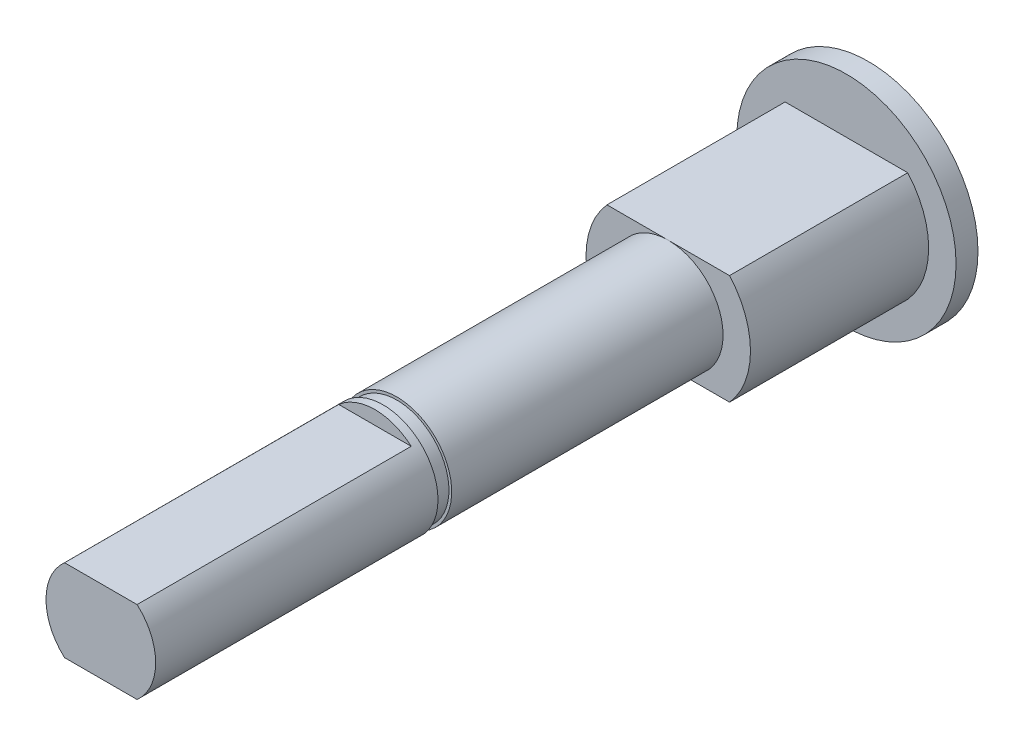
ISO-10303-21;
HEADER;
FILE_DESCRIPTION(('STEP AP214'),'2;1');
FILE_NAME('part.step','',(''),(''),'','','');
FILE_SCHEMA(('AUTOMOTIVE_DESIGN { 1 0 10303 214 1 1 1 1 }'));
ENDSEC;
DATA;
#1=APPLICATION_CONTEXT('core data for automotive mechanical design processes');
#2=APPLICATION_PROTOCOL_DEFINITION('international standard','automotive_design',2000,#1);
#3=PRODUCT_CONTEXT('',#1,'mechanical');
#4=PRODUCT('Part','Part','',(#3));
#5=PRODUCT_RELATED_PRODUCT_CATEGORY('part','',(#4));
#6=PRODUCT_DEFINITION_FORMATION('','',#4);
#7=PRODUCT_DEFINITION_CONTEXT('part definition',#1,'design');
#8=PRODUCT_DEFINITION('design','',#6,#7);
#9=PRODUCT_DEFINITION_SHAPE('','',#8);
#10=(LENGTH_UNIT() NAMED_UNIT(*) SI_UNIT(.MILLI.,.METRE.));
#11=(NAMED_UNIT(*) PLANE_ANGLE_UNIT() SI_UNIT($,.RADIAN.));
#12=(NAMED_UNIT(*) SI_UNIT($,.STERADIAN.) SOLID_ANGLE_UNIT());
#13=UNCERTAINTY_MEASURE_WITH_UNIT(LENGTH_MEASURE(1.E-05),#10,'distance_accuracy_value','');
#14=(GEOMETRIC_REPRESENTATION_CONTEXT(3) GLOBAL_UNCERTAINTY_ASSIGNED_CONTEXT((#13)) GLOBAL_UNIT_ASSIGNED_CONTEXT((#10,
#11,#12)) REPRESENTATION_CONTEXT('',''));
#15=CARTESIAN_POINT('',(0.,0.,0.));
#16=DIRECTION('',(0.,0.,1.));
#17=DIRECTION('',(1.,0.,0.));
#18=AXIS2_PLACEMENT_3D('',#15,#16,#17);
#19=CARTESIAN_POINT('',(0.,0.,17.2));
#20=DIRECTION('',(0.,0.,1.));
#21=DIRECTION('',(1.,0.,0.));
#22=AXIS2_PLACEMENT_3D('',#19,#20,#21);
#23=PLANE('',#22);
#24=DIRECTION('',(-1.,0.,0.));
#25=VECTOR('',#24,1.);
#26=CARTESIAN_POINT('',(-1.3228756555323,1.5,17.2));
#27=LINE('',#26,#25);
#28=CARTESIAN_POINT('',(1.3228756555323,1.5,17.2));
#29=VERTEX_POINT('',#28);
#30=CARTESIAN_POINT('',(-1.3228756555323,1.5,17.2));
#31=VERTEX_POINT('',#30);
#32=EDGE_CURVE('E116',#29,#31,#27,.T.);
#33=ORIENTED_EDGE('',*,*,#32,.F.);
#34=CARTESIAN_POINT('',(0.,0.,17.2));
#35=DIRECTION('',(0.,0.,1.));
#36=DIRECTION('',(1.,0.,0.));
#37=AXIS2_PLACEMENT_3D('',#34,#35,#36);
#38=CIRCLE('',#37,2.);
#39=EDGE_CURVE('E56',#29,#31,#38,.T.);
#40=ORIENTED_EDGE('',*,*,#39,.T.);
#41=EDGE_LOOP('',(#33,#40));
#42=FACE_BOUND('',#41,.T.);
#43=ADVANCED_FACE('F32',(#42),#23,.T.);
#44=CARTESIAN_POINT('',(0.,0.,6.5));
#45=DIRECTION('',(0.,0.,1.));
#46=DIRECTION('',(1.,0.,0.));
#47=AXIS2_PLACEMENT_3D('',#44,#45,#46);
#48=PLANE('',#47);
#49=CARTESIAN_POINT('',(0.,0.,6.5));
#50=DIRECTION('',(0.,0.,1.));
#51=DIRECTION('',(1.,0.,0.));
#52=AXIS2_PLACEMENT_3D('',#49,#50,#51);
#53=CIRCLE('',#52,2.);
#54=CARTESIAN_POINT('',(0.,2.,6.5));
#55=VERTEX_POINT('',#54);
#56=CARTESIAN_POINT('',(0.,-2.,6.5));
#57=VERTEX_POINT('',#56);
#58=EDGE_CURVE('E43',#55,#57,#53,.T.);
#59=ORIENTED_EDGE('',*,*,#58,.F.);
#60=DIRECTION('',(-1.,0.,0.));
#61=VECTOR('',#60,1.);
#62=CARTESIAN_POINT('',(-2.23606797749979,2.,6.5));
#63=LINE('',#62,#61);
#64=CARTESIAN_POINT('',(-2.23606797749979,2.,6.5));
#65=VERTEX_POINT('',#64);
#66=EDGE_CURVE('E182',#55,#65,#63,.T.);
#67=ORIENTED_EDGE('',*,*,#66,.T.);
#68=CARTESIAN_POINT('',(0.,0.,6.5));
#69=DIRECTION('',(0.,0.,1.));
#70=DIRECTION('',(1.,0.,0.));
#71=AXIS2_PLACEMENT_3D('',#68,#69,#70);
#72=CIRCLE('',#71,3.);
#73=CARTESIAN_POINT('',(-2.23606797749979,-2.,6.5));
#74=VERTEX_POINT('',#73);
#75=EDGE_CURVE('E173',#65,#74,#72,.T.);
#76=ORIENTED_EDGE('',*,*,#75,.T.);
#77=DIRECTION('',(1.,0.,0.));
#78=VECTOR('',#77,1.);
#79=CARTESIAN_POINT('',(-2.23606797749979,-2.,6.5));
#80=LINE('',#79,#78);
#81=EDGE_CURVE('E177',#74,#57,#80,.T.);
#82=ORIENTED_EDGE('',*,*,#81,.T.);
#83=EDGE_LOOP('',(#59,#67,#76,#82));
#84=FACE_BOUND('',#83,.T.);
#85=ADVANCED_FACE('F226',(#84),#48,.T.);
#86=CARTESIAN_POINT('',(0.,0.,6.5));
#87=DIRECTION('',(0.,0.,-1.));
#88=DIRECTION('',(-1.,0.,0.));
#89=AXIS2_PLACEMENT_3D('',#86,#87,#88);
#90=CYLINDRICAL_SURFACE('',#89,3.);
#91=CARTESIAN_POINT('',(0.,0.,0.));
#92=DIRECTION('',(0.,0.,1.));
#93=DIRECTION('',(1.,0.,0.));
#94=AXIS2_PLACEMENT_3D('',#91,#92,#93);
#95=CIRCLE('',#94,3.);
#96=CARTESIAN_POINT('',(-2.23606797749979,2.,0.));
#97=VERTEX_POINT('',#96);
#98=CARTESIAN_POINT('',(-2.23606797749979,-2.,0.));
#99=VERTEX_POINT('',#98);
#100=EDGE_CURVE('E161',#97,#99,#95,.T.);
#101=ORIENTED_EDGE('',*,*,#100,.T.);
#102=DIRECTION('',(0.,0.,-1.));
#103=VECTOR('',#102,1.);
#104=CARTESIAN_POINT('',(-2.23606797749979,-2.,6.5));
#105=LINE('',#104,#103);
#106=EDGE_CURVE('E41',#74,#99,#105,.T.);
#107=ORIENTED_EDGE('',*,*,#106,.F.);
#108=ORIENTED_EDGE('',*,*,#75,.F.);
#109=DIRECTION('',(0.,0.,-1.));
#110=VECTOR('',#109,1.);
#111=CARTESIAN_POINT('',(-2.23606797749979,2.,6.5));
#112=LINE('',#111,#110);
#113=EDGE_CURVE('E185',#65,#97,#112,.T.);
#114=ORIENTED_EDGE('',*,*,#113,.T.);
#115=EDGE_LOOP('',(#101,#107,#108,#114));
#116=FACE_BOUND('',#115,.T.);
#117=ADVANCED_FACE('F34',(#116),#90,.T.);
#118=CARTESIAN_POINT('',(-2.23606797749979,-2.,6.5));
#119=DIRECTION('',(0.,1.,0.));
#120=DIRECTION('',(-1.,0.,0.));
#121=AXIS2_PLACEMENT_3D('',#118,#119,#120);
#122=PLANE('',#121);
#123=DIRECTION('',(1.,0.,0.));
#124=VECTOR('',#123,1.);
#125=CARTESIAN_POINT('',(-2.23606797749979,-2.,0.));
#126=LINE('',#125,#124);
#127=CARTESIAN_POINT('',(2.23606797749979,-2.,0.));
#128=VERTEX_POINT('',#127);
#129=EDGE_CURVE('E164',#99,#128,#126,.T.);
#130=ORIENTED_EDGE('',*,*,#129,.T.);
#131=DIRECTION('',(0.,0.,-1.));
#132=VECTOR('',#131,1.);
#133=CARTESIAN_POINT('',(2.23606797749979,-2.,6.5));
#134=LINE('',#133,#132);
#135=CARTESIAN_POINT('',(2.23606797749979,-2.,6.5));
#136=VERTEX_POINT('',#135);
#137=EDGE_CURVE('E191',#136,#128,#134,.T.);
#138=ORIENTED_EDGE('',*,*,#137,.F.);
#139=EDGE_CURVE('E176',#57,#136,#80,.T.);
#140=ORIENTED_EDGE('',*,*,#139,.F.);
#141=ORIENTED_EDGE('',*,*,#81,.F.);
#142=ORIENTED_EDGE('',*,*,#106,.T.);
#143=EDGE_LOOP('',(#130,#138,#140,#141,#142));
#144=FACE_BOUND('',#143,.T.);
#145=ADVANCED_FACE('F341',(#144),#122,.F.);
#146=CARTESIAN_POINT('',(0.,0.,6.5));
#147=DIRECTION('',(0.,0.,-1.));
#148=DIRECTION('',(-1.,0.,0.));
#149=AXIS2_PLACEMENT_3D('',#146,#147,#148);
#150=CYLINDRICAL_SURFACE('',#149,3.);
#151=CARTESIAN_POINT('',(0.,0.,0.));
#152=DIRECTION('',(0.,0.,1.));
#153=DIRECTION('',(1.,0.,0.));
#154=AXIS2_PLACEMENT_3D('',#151,#152,#153);
#155=CIRCLE('',#154,3.);
#156=CARTESIAN_POINT('',(2.23606797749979,2.,0.));
#157=VERTEX_POINT('',#156);
#158=EDGE_CURVE('E167',#128,#157,#155,.T.);
#159=ORIENTED_EDGE('',*,*,#158,.T.);
#160=DIRECTION('',(0.,0.,-1.));
#161=VECTOR('',#160,1.);
#162=CARTESIAN_POINT('',(2.23606797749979,2.,6.5));
#163=LINE('',#162,#161);
#164=CARTESIAN_POINT('',(2.23606797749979,2.,6.5));
#165=VERTEX_POINT('',#164);
#166=EDGE_CURVE('E188',#165,#157,#163,.T.);
#167=ORIENTED_EDGE('',*,*,#166,.F.);
#168=CARTESIAN_POINT('',(0.,0.,6.5));
#169=DIRECTION('',(0.,0.,1.));
#170=DIRECTION('',(1.,0.,0.));
#171=AXIS2_PLACEMENT_3D('',#168,#169,#170);
#172=CIRCLE('',#171,3.);
#173=EDGE_CURVE('E180',#136,#165,#172,.T.);
#174=ORIENTED_EDGE('',*,*,#173,.F.);
#175=ORIENTED_EDGE('',*,*,#137,.T.);
#176=EDGE_LOOP('',(#159,#167,#174,#175));
#177=FACE_BOUND('',#176,.T.);
#178=ADVANCED_FACE('F333',(#177),#150,.T.);
#179=CARTESIAN_POINT('',(-2.23606797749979,2.,6.5));
#180=DIRECTION('',(0.,-1.,0.));
#181=DIRECTION('',(0.,0.,-1.));
#182=AXIS2_PLACEMENT_3D('',#179,#180,#181);
#183=PLANE('',#182);
#184=DIRECTION('',(-1.,0.,0.));
#185=VECTOR('',#184,1.);
#186=CARTESIAN_POINT('',(-2.23606797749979,2.,0.));
#187=LINE('',#186,#185);
#188=EDGE_CURVE('E170',#157,#97,#187,.T.);
#189=ORIENTED_EDGE('',*,*,#188,.T.);
#190=ORIENTED_EDGE('',*,*,#113,.F.);
#191=ORIENTED_EDGE('',*,*,#66,.F.);
#192=EDGE_CURVE('E183',#165,#55,#63,.T.);
#193=ORIENTED_EDGE('',*,*,#192,.F.);
#194=ORIENTED_EDGE('',*,*,#166,.T.);
#195=EDGE_LOOP('',(#189,#190,#191,#193,#194));
#196=FACE_BOUND('',#195,.T.);
#197=ADVANCED_FACE('F321',(#196),#183,.F.);
#198=EDGE_CURVE('E11',#57,#55,#53,.T.);
#199=ORIENTED_EDGE('',*,*,#198,.F.);
#200=ORIENTED_EDGE('',*,*,#139,.T.);
#201=ORIENTED_EDGE('',*,*,#173,.T.);
#202=ORIENTED_EDGE('',*,*,#192,.T.);
#203=EDGE_LOOP('',(#199,#200,#201,#202));
#204=FACE_BOUND('',#203,.T.);
#205=ADVANCED_FACE('F232',(#204),#48,.T.);
#206=CARTESIAN_POINT('',(0.,0.,0.));
#207=DIRECTION('',(0.,0.,-1.));
#208=DIRECTION('',(-1.,0.,0.));
#209=AXIS2_PLACEMENT_3D('',#206,#207,#208);
#210=PLANE('',#209);
#211=CARTESIAN_POINT('',(0.,0.,0.));
#212=DIRECTION('',(0.,0.,-1.));
#213=DIRECTION('',(-1.,0.,0.));
#214=AXIS2_PLACEMENT_3D('',#211,#212,#213);
#215=CIRCLE('',#214,4.);
#216=CARTESIAN_POINT('',(-4.,0.,0.));
#217=VERTEX_POINT('',#216);
#218=EDGE_CURVE('E155',#217,#217,#215,.T.);
#219=ORIENTED_EDGE('',*,*,#218,.F.);
#220=EDGE_LOOP('',(#219));
#221=FACE_BOUND('',#220,.T.);
#222=ORIENTED_EDGE('',*,*,#129,.F.);
#223=ORIENTED_EDGE('',*,*,#100,.F.);
#224=ORIENTED_EDGE('',*,*,#188,.F.);
#225=ORIENTED_EDGE('',*,*,#158,.F.);
#226=EDGE_LOOP('',(#222,#223,#224,#225));
#227=FACE_BOUND('',#226,.T.);
#228=ADVANCED_FACE('F320',(#221,#227),#210,.F.);
#229=CARTESIAN_POINT('',(0.,0.,-0.8));
#230=DIRECTION('',(0.,0.,1.));
#231=DIRECTION('',(1.,0.,0.));
#232=AXIS2_PLACEMENT_3D('',#229,#230,#231);
#233=CYLINDRICAL_SURFACE('',#232,4.);
#234=CARTESIAN_POINT('',(0.,0.,-0.8));
#235=DIRECTION('',(0.,0.,-1.));
#236=DIRECTION('',(-1.,0.,0.));
#237=AXIS2_PLACEMENT_3D('',#234,#235,#236);
#238=CIRCLE('',#237,4.);
#239=CARTESIAN_POINT('',(-4.,0.,-0.8));
#240=VERTEX_POINT('',#239);
#241=EDGE_CURVE('E158',#240,#240,#238,.T.);
#242=ORIENTED_EDGE('',*,*,#241,.F.);
#243=EDGE_LOOP('',(#242));
#244=FACE_BOUND('',#243,.T.);
#245=ORIENTED_EDGE('',*,*,#218,.T.);
#246=EDGE_LOOP('',(#245));
#247=FACE_BOUND('',#246,.T.);
#248=ADVANCED_FACE('F362',(#244,#247),#233,.T.);
#249=CARTESIAN_POINT('',(0.,0.,-0.8));
#250=DIRECTION('',(0.,0.,-1.));
#251=DIRECTION('',(-1.,0.,0.));
#252=AXIS2_PLACEMENT_3D('',#249,#250,#251);
#253=PLANE('',#252);
#254=ORIENTED_EDGE('',*,*,#241,.T.);
#255=EDGE_LOOP('',(#254));
#256=FACE_BOUND('',#255,.T.);
#257=ADVANCED_FACE('F219',(#256),#253,.T.);
#258=CARTESIAN_POINT('',(0.,0.,17.2));
#259=DIRECTION('',(0.,0.,-1.));
#260=DIRECTION('',(-1.,0.,0.));
#261=AXIS2_PLACEMENT_3D('',#258,#259,#260);
#262=CYLINDRICAL_SURFACE('',#261,2.);
#263=CARTESIAN_POINT('',(0.,0.,16.4));
#264=DIRECTION('',(0.,0.,-1.));
#265=DIRECTION('',(-1.,0.,0.));
#266=AXIS2_PLACEMENT_3D('',#263,#264,#265);
#267=CIRCLE('',#266,2.);
#268=CARTESIAN_POINT('',(-2.,0.,16.4));
#269=VERTEX_POINT('',#268);
#270=EDGE_CURVE('E151',#269,#269,#267,.T.);
#271=ORIENTED_EDGE('',*,*,#270,.T.);
#272=EDGE_LOOP('',(#271));
#273=FACE_BOUND('',#272,.T.);
#274=ORIENTED_EDGE('',*,*,#58,.T.);
#275=ORIENTED_EDGE('',*,*,#198,.T.);
#276=EDGE_LOOP('',(#274,#275));
#277=FACE_BOUND('',#276,.T.);
#278=ADVANCED_FACE('F209',(#273,#277),#262,.T.);
#279=CARTESIAN_POINT('',(0.,2.48932755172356,16.9));
#280=DIRECTION('',(0.,0.,1.));
#281=DIRECTION('',(1.,0.,0.));
#282=AXIS2_PLACEMENT_3D('',#279,#280,#281);
#283=PLANE('',#282);
#284=CARTESIAN_POINT('',(0.,0.,16.9));
#285=DIRECTION('',(0.,0.,-1.));
#286=DIRECTION('',(-1.,0.,0.));
#287=AXIS2_PLACEMENT_3D('',#284,#285,#286);
#288=CIRCLE('',#287,1.9);
#289=CARTESIAN_POINT('',(-1.9,0.,16.9));
#290=VERTEX_POINT('',#289);
#291=EDGE_CURVE('E149',#290,#290,#288,.T.);
#292=ORIENTED_EDGE('',*,*,#291,.F.);
#293=EDGE_LOOP('',(#292));
#294=FACE_BOUND('',#293,.T.);
#295=CARTESIAN_POINT('',(0.,0.,16.9));
#296=DIRECTION('',(0.,0.,1.));
#297=DIRECTION('',(1.,0.,0.));
#298=AXIS2_PLACEMENT_3D('',#295,#296,#297);
#299=CIRCLE('',#298,2.);
#300=CARTESIAN_POINT('',(2.,0.,16.9));
#301=VERTEX_POINT('',#300);
#302=EDGE_CURVE('E154',#301,#301,#299,.T.);
#303=ORIENTED_EDGE('',*,*,#302,.F.);
#304=EDGE_LOOP('',(#303));
#305=FACE_BOUND('',#304,.T.);
#306=ADVANCED_FACE('F206',(#294,#305),#283,.F.);
#307=CARTESIAN_POINT('',(0.,2.48932755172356,16.4));
#308=DIRECTION('',(0.,0.,-1.));
#309=DIRECTION('',(-1.,0.,0.));
#310=AXIS2_PLACEMENT_3D('',#307,#308,#309);
#311=PLANE('',#310);
#312=CARTESIAN_POINT('',(0.,0.,16.4));
#313=DIRECTION('',(0.,0.,-1.));
#314=DIRECTION('',(-1.,0.,0.));
#315=AXIS2_PLACEMENT_3D('',#312,#313,#314);
#316=CIRCLE('',#315,1.9);
#317=CARTESIAN_POINT('',(-1.9,0.,16.4));
#318=VERTEX_POINT('',#317);
#319=EDGE_CURVE('E123',#318,#318,#316,.T.);
#320=ORIENTED_EDGE('',*,*,#319,.T.);
#321=EDGE_LOOP('',(#320));
#322=FACE_BOUND('',#321,.T.);
#323=ORIENTED_EDGE('',*,*,#270,.F.);
#324=EDGE_LOOP('',(#323));
#325=FACE_BOUND('',#324,.T.);
#326=ADVANCED_FACE('F208',(#322,#325),#311,.F.);
#327=CARTESIAN_POINT('',(0.,0.,0.));
#328=DIRECTION('',(0.,0.,-1.));
#329=DIRECTION('',(-1.,0.,0.));
#330=AXIS2_PLACEMENT_3D('',#327,#328,#329);
#331=CYLINDRICAL_SURFACE('',#330,1.9);
#332=ORIENTED_EDGE('',*,*,#319,.F.);
#333=EDGE_LOOP('',(#332));
#334=FACE_BOUND('',#333,.T.);
#335=ORIENTED_EDGE('',*,*,#291,.T.);
#336=EDGE_LOOP('',(#335));
#337=FACE_BOUND('',#336,.T.);
#338=ADVANCED_FACE('F216',(#334,#337),#331,.T.);
#339=DIRECTION('',(1.,0.,0.));
#340=VECTOR('',#339,1.);
#341=CARTESIAN_POINT('',(-1.3228756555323,-1.5,17.2));
#342=LINE('',#341,#340);
#343=CARTESIAN_POINT('',(-1.3228756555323,-1.5,17.2));
#344=VERTEX_POINT('',#343);
#345=CARTESIAN_POINT('',(1.3228756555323,-1.5,17.2));
#346=VERTEX_POINT('',#345);
#347=EDGE_CURVE('E49',#344,#346,#342,.T.);
#348=ORIENTED_EDGE('',*,*,#347,.F.);
#349=EDGE_CURVE('E103',#344,#346,#38,.T.);
#350=ORIENTED_EDGE('',*,*,#349,.T.);
#351=EDGE_LOOP('',(#348,#350));
#352=FACE_BOUND('',#351,.T.);
#353=ADVANCED_FACE('F104',(#352),#23,.T.);
#354=ORIENTED_EDGE('',*,*,#302,.T.);
#355=EDGE_LOOP('',(#354));
#356=FACE_BOUND('',#355,.T.);
#357=ORIENTED_EDGE('',*,*,#39,.F.);
#358=DIRECTION('',(0.,0.,-1.));
#359=VECTOR('',#358,1.);
#360=CARTESIAN_POINT('',(1.32287565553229,1.5,27.2));
#361=LINE('',#360,#359);
#362=CARTESIAN_POINT('',(1.32287565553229,1.5,27.2));
#363=VERTEX_POINT('',#362);
#364=EDGE_CURVE('E121',#363,#29,#361,.T.);
#365=ORIENTED_EDGE('',*,*,#364,.F.);
#366=CARTESIAN_POINT('',(0.,0.,27.2));
#367=DIRECTION('',(0.,0.,1.));
#368=DIRECTION('',(1.,0.,0.));
#369=AXIS2_PLACEMENT_3D('',#366,#367,#368);
#370=CIRCLE('',#369,2.);
#371=CARTESIAN_POINT('',(1.3228756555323,-1.5,27.2));
#372=VERTEX_POINT('',#371);
#373=EDGE_CURVE('E120',#372,#363,#370,.T.);
#374=ORIENTED_EDGE('',*,*,#373,.F.);
#375=DIRECTION('',(0.,0.,-1.));
#376=VECTOR('',#375,1.);
#377=CARTESIAN_POINT('',(1.3228756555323,-1.5,27.2));
#378=LINE('',#377,#376);
#379=EDGE_CURVE('E113',#372,#346,#378,.T.);
#380=ORIENTED_EDGE('',*,*,#379,.T.);
#381=ORIENTED_EDGE('',*,*,#349,.F.);
#382=DIRECTION('',(0.,0.,-1.));
#383=VECTOR('',#382,1.);
#384=CARTESIAN_POINT('',(-1.3228756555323,-1.5,27.2));
#385=LINE('',#384,#383);
#386=CARTESIAN_POINT('',(-1.3228756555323,-1.5,27.2));
#387=VERTEX_POINT('',#386);
#388=EDGE_CURVE('E115',#387,#344,#385,.T.);
#389=ORIENTED_EDGE('',*,*,#388,.F.);
#390=CARTESIAN_POINT('',(0.,0.,27.2));
#391=DIRECTION('',(0.,0.,1.));
#392=DIRECTION('',(1.,0.,0.));
#393=AXIS2_PLACEMENT_3D('',#390,#391,#392);
#394=CIRCLE('',#393,2.);
#395=CARTESIAN_POINT('',(-1.3228756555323,1.5,27.2));
#396=VERTEX_POINT('',#395);
#397=EDGE_CURVE('E135',#396,#387,#394,.T.);
#398=ORIENTED_EDGE('',*,*,#397,.F.);
#399=DIRECTION('',(0.,0.,-1.));
#400=VECTOR('',#399,1.);
#401=CARTESIAN_POINT('',(-1.3228756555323,1.5,27.2));
#402=LINE('',#401,#400);
#403=EDGE_CURVE('E126',#396,#31,#402,.T.);
#404=ORIENTED_EDGE('',*,*,#403,.T.);
#405=EDGE_LOOP('',(#357,#365,#374,#380,#381,#389,#398,#404));
#406=FACE_BOUND('',#405,.T.);
#407=ADVANCED_FACE('F118',(#356,#406),#262,.T.);
#408=CARTESIAN_POINT('',(-1.3228756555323,-1.5,27.2));
#409=DIRECTION('',(0.,1.,0.));
#410=DIRECTION('',(-1.,0.,0.));
#411=AXIS2_PLACEMENT_3D('',#408,#409,#410);
#412=PLANE('',#411);
#413=ORIENTED_EDGE('',*,*,#347,.T.);
#414=ORIENTED_EDGE('',*,*,#379,.F.);
#415=DIRECTION('',(1.,0.,0.));
#416=VECTOR('',#415,1.);
#417=CARTESIAN_POINT('',(-1.3228756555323,-1.5,27.2));
#418=LINE('',#417,#416);
#419=EDGE_CURVE('E142',#387,#372,#418,.T.);
#420=ORIENTED_EDGE('',*,*,#419,.F.);
#421=ORIENTED_EDGE('',*,*,#388,.T.);
#422=EDGE_LOOP('',(#413,#414,#420,#421));
#423=FACE_BOUND('',#422,.T.);
#424=ADVANCED_FACE('F112',(#423),#412,.F.);
#425=CARTESIAN_POINT('',(-1.3228756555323,1.5,27.2));
#426=DIRECTION('',(0.,-1.,0.));
#427=DIRECTION('',(0.,0.,-1.));
#428=AXIS2_PLACEMENT_3D('',#425,#426,#427);
#429=PLANE('',#428);
#430=ORIENTED_EDGE('',*,*,#32,.T.);
#431=ORIENTED_EDGE('',*,*,#403,.F.);
#432=DIRECTION('',(-1.,0.,0.));
#433=VECTOR('',#432,1.);
#434=CARTESIAN_POINT('',(-1.3228756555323,1.5,27.2));
#435=LINE('',#434,#433);
#436=EDGE_CURVE('E145',#363,#396,#435,.T.);
#437=ORIENTED_EDGE('',*,*,#436,.F.);
#438=ORIENTED_EDGE('',*,*,#364,.T.);
#439=EDGE_LOOP('',(#430,#431,#437,#438));
#440=FACE_BOUND('',#439,.T.);
#441=ADVANCED_FACE('F246',(#440),#429,.F.);
#442=CARTESIAN_POINT('',(0.,0.,27.2));
#443=DIRECTION('',(0.,0.,1.));
#444=DIRECTION('',(1.,0.,0.));
#445=AXIS2_PLACEMENT_3D('',#442,#443,#444);
#446=PLANE('',#445);
#447=ORIENTED_EDGE('',*,*,#397,.T.);
#448=ORIENTED_EDGE('',*,*,#419,.T.);
#449=ORIENTED_EDGE('',*,*,#373,.T.);
#450=ORIENTED_EDGE('',*,*,#436,.T.);
#451=EDGE_LOOP('',(#447,#448,#449,#450));
#452=FACE_BOUND('',#451,.T.);
#453=ADVANCED_FACE('F249',(#452),#446,.T.);
#454=CLOSED_SHELL('',(#43,#85,#117,#145,#178,#197,#205,#228,#248,#257,#278,#306,#326,#338,#353,
#407,#424,#441,#453));
#455=MANIFOLD_SOLID_BREP('B2',#454);
#456=ADVANCED_BREP_SHAPE_REPRESENTATION('',(#18,#455),#14);
#457=SHAPE_DEFINITION_REPRESENTATION(#9,#456);
ENDSEC;
END-ISO-10303-21;
